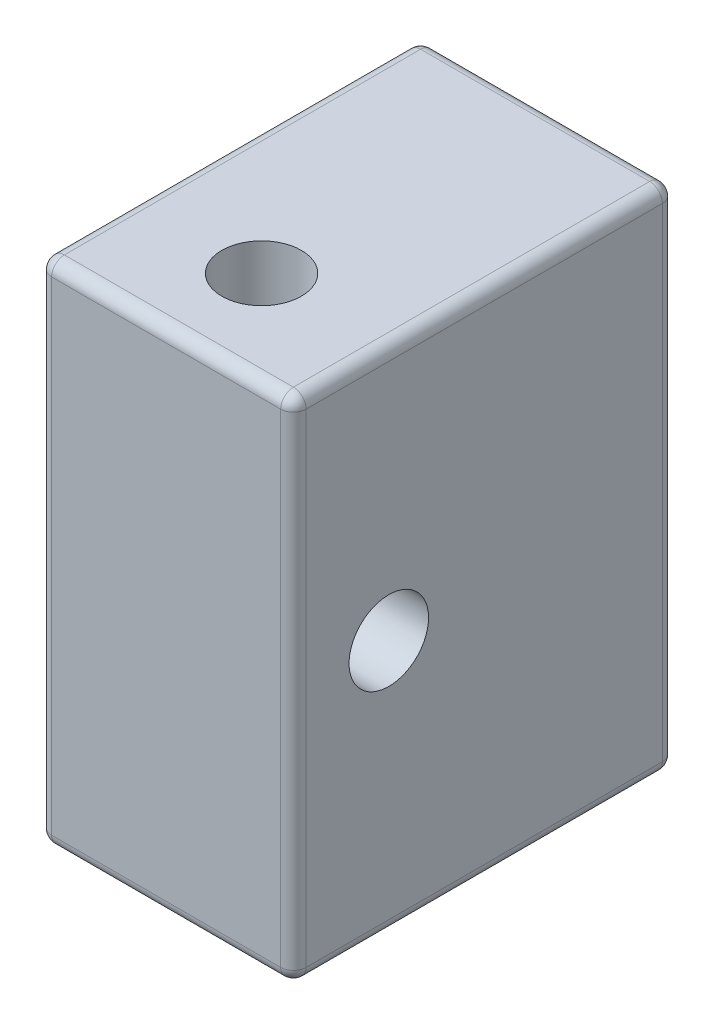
from build123d import *

# Parameters (mm, degrees)
SKETCH1_W          = 76.2
SKETCH1_H          = 101.6
EXTRUDE1_DEPTH     = 50.8
SKETCH2_R          = 7.9375
CUT_EXTRUDE1_DEPTH = 25.4
FILLET1_R          = 2.54
SKETCH3_R          = 7.9375
CUT_EXTRUDE3_DEPTH = 12.7
CUT_EXTRUDE4_START = -12.7
SKETCH4_R          = 7.9375
CUT_EXTRUDE4_DEPTH = 12.7


with BuildPart() as part:
    # Sketch1 → Extrude1 (new body)
    with BuildSketch(Plane(origin=(0, 0, 0), x_dir=(0, 0, -1), z_dir=(1, 0, 0))):
        Rectangle(SKETCH1_W, SKETCH1_H)
    extrude(amount=EXTRUDE1_DEPTH)

    # Sketch2 → Cut-Extrude1 (cut)
    with BuildSketch(Plane(origin=(50.8, 0, 0), x_dir=(0, 0, -1), z_dir=(1, 0, 0))):
        with Locations((-19.05, 0)):
            Circle(SKETCH2_R)
    extrude(amount=-CUT_EXTRUDE1_DEPTH, mode=Mode.SUBTRACT)

    # Fillet1
    fillet1_edges = [part.edges().sort_by_distance(p)[0] for p in [
        (50.8, 0, -38.1),
        (50.8, 50.8, 0),
        (50.8, 0, 38.1),
        (0, 50.8, 0),
        (0, 0, -38.1),
        (0, -50.8, 0),
        (0, 0, 38.1),
        (50.8, -50.8, 0),
        (25.4, 50.8, 38.1),
        (25.4, 50.8, -38.1),
        (25.4, -50.8, -38.1),
        (25.4, -50.8, 38.1),
    ]]
    fillet(fillet1_edges, radius=FILLET1_R)

    # Sketch3 → Cut-Extrude3 (cut)
    with BuildSketch(Plane.XZ.offset(-50.8)):
        with Locations(Location((25.4, 19.05, 0), (0, 0, 270))):
            Circle(SKETCH3_R)
    extrude(amount=CUT_EXTRUDE3_DEPTH, mode=Mode.SUBTRACT)

    # Sketch4 → Cut-Extrude4 (cut)
    with BuildSketch(Plane.XZ.offset(50.8).offset(CUT_EXTRUDE4_START)):
        with Locations(Location((25.4, 19.05, 0), (0, 0, 270))):
            Circle(SKETCH4_R)
    extrude(amount=CUT_EXTRUDE4_DEPTH, mode=Mode.SUBTRACT)


solid = part.part
